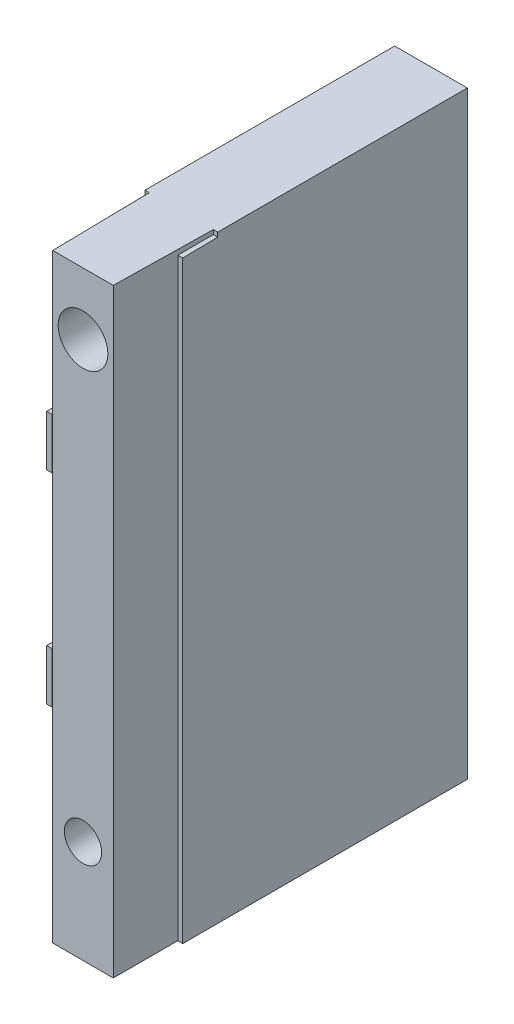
ISO-10303-21;
HEADER;
FILE_DESCRIPTION(('STEP AP214'),'2;1');
FILE_NAME('part.step','',(''),(''),'','','');
FILE_SCHEMA(('AUTOMOTIVE_DESIGN { 1 0 10303 214 1 1 1 1 }'));
ENDSEC;
DATA;
#1=APPLICATION_CONTEXT('core data for automotive mechanical design processes');
#2=APPLICATION_PROTOCOL_DEFINITION('international standard','automotive_design',2000,#1);
#3=PRODUCT_CONTEXT('',#1,'mechanical');
#4=PRODUCT('Part','Part','',(#3));
#5=PRODUCT_RELATED_PRODUCT_CATEGORY('part','',(#4));
#6=PRODUCT_DEFINITION_FORMATION('','',#4);
#7=PRODUCT_DEFINITION_CONTEXT('part definition',#1,'design');
#8=PRODUCT_DEFINITION('design','',#6,#7);
#9=PRODUCT_DEFINITION_SHAPE('','',#8);
#10=(LENGTH_UNIT() NAMED_UNIT(*) SI_UNIT(.MILLI.,.METRE.));
#11=(NAMED_UNIT(*) PLANE_ANGLE_UNIT() SI_UNIT($,.RADIAN.));
#12=(NAMED_UNIT(*) SI_UNIT($,.STERADIAN.) SOLID_ANGLE_UNIT());
#13=UNCERTAINTY_MEASURE_WITH_UNIT(LENGTH_MEASURE(1.E-05),#10,'distance_accuracy_value','');
#14=(GEOMETRIC_REPRESENTATION_CONTEXT(3) GLOBAL_UNCERTAINTY_ASSIGNED_CONTEXT((#13)) GLOBAL_UNIT_ASSIGNED_CONTEXT((#10,
#11,#12)) REPRESENTATION_CONTEXT('',''));
#15=CARTESIAN_POINT('',(0.,0.,0.));
#16=DIRECTION('',(0.,0.,1.));
#17=DIRECTION('',(1.,0.,0.));
#18=AXIS2_PLACEMENT_3D('',#15,#16,#17);
#19=CARTESIAN_POINT('',(-91.8,64.515,0.));
#20=DIRECTION('',(0.,0.,1.));
#21=DIRECTION('',(1.,0.,0.));
#22=AXIS2_PLACEMENT_3D('',#19,#20,#21);
#23=PLANE('',#22);
#24=CARTESIAN_POINT('',(8.02628761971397E-06,30.,0.));
#25=DIRECTION('',(0.,0.,1.));
#26=DIRECTION('',(1.,0.,0.));
#27=AXIS2_PLACEMENT_3D('',#24,#25,#26);
#28=CIRCLE('',#27,4.);
#29=CARTESIAN_POINT('',(4.00000802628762,30.,0.));
#30=VERTEX_POINT('',#29);
#31=EDGE_CURVE('E509',#30,#30,#28,.T.);
#32=ORIENTED_EDGE('',*,*,#31,.F.);
#33=EDGE_LOOP('',(#32));
#34=FACE_BOUND('',#33,.T.);
#35=CARTESIAN_POINT('',(8.02628752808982E-06,-40.,0.));
#36=DIRECTION('',(0.,0.,1.));
#37=DIRECTION('',(1.,0.,0.));
#38=AXIS2_PLACEMENT_3D('',#35,#36,#37);
#39=CIRCLE('',#38,3.);
#40=CARTESIAN_POINT('',(3.00000802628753,-40.,0.));
#41=VERTEX_POINT('',#40);
#42=EDGE_CURVE('E482',#41,#41,#39,.F.);
#43=ORIENTED_EDGE('',*,*,#42,.T.);
#44=EDGE_LOOP('',(#43));
#45=FACE_BOUND('',#44,.T.);
#46=DIRECTION('',(-1.,0.,0.));
#47=VECTOR('',#46,1.);
#48=CARTESIAN_POINT('',(-91.8,-56.5330416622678,0.));
#49=LINE('',#48,#47);
#50=CARTESIAN_POINT('',(4.87095833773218,-56.5330416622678,0.));
#51=VERTEX_POINT('',#50);
#52=CARTESIAN_POINT('',(-4.87095833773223,-56.5330416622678,0.));
#53=VERTEX_POINT('',#52);
#54=EDGE_CURVE('E334',#51,#53,#49,.T.);
#55=ORIENTED_EDGE('',*,*,#54,.F.);
#56=DIRECTION('',(0.,-1.,0.));
#57=VECTOR('',#56,1.);
#58=CARTESIAN_POINT('',(4.87095833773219,41.565,0.));
#59=LINE('',#58,#57);
#60=CARTESIAN_POINT('',(4.87095833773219,39.9924836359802,0.));
#61=VERTEX_POINT('',#60);
#62=EDGE_CURVE('E313',#51,#61,#59,.F.);
#63=ORIENTED_EDGE('',*,*,#62,.T.);
#64=DIRECTION('',(-1.,0.,0.));
#65=VECTOR('',#64,1.);
#66=CARTESIAN_POINT('',(-65.6145427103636,39.9924836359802,0.));
#67=LINE('',#66,#65);
#68=CARTESIAN_POINT('',(-4.87095833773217,39.9924836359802,0.));
#69=VERTEX_POINT('',#68);
#70=EDGE_CURVE('E521',#69,#61,#67,.F.);
#71=ORIENTED_EDGE('',*,*,#70,.F.);
#72=DIRECTION('',(0.,1.,0.));
#73=VECTOR('',#72,1.);
#74=CARTESIAN_POINT('',(-4.87095833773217,41.565,0.));
#75=LINE('',#74,#73);
#76=EDGE_CURVE('E309',#69,#53,#75,.F.);
#77=ORIENTED_EDGE('',*,*,#76,.T.);
#78=EDGE_LOOP('',(#55,#63,#71,#77));
#79=FACE_BOUND('',#78,.T.);
#80=ADVANCED_FACE('F38',(#34,#45,#79),#23,.T.);
#81=CARTESIAN_POINT('',(-5.84844197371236,28.1390208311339,-56.));
#82=DIRECTION('',(-1.,0.,0.));
#83=DIRECTION('',(0.,-1.,0.));
#84=AXIS2_PLACEMENT_3D('',#81,#82,#83);
#85=PLANE('',#84);
#86=DIRECTION('',(0.,-0.0174524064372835,0.999847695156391));
#87=VECTOR('',#86,1.);
#88=CARTESIAN_POINT('',(-5.84844197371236,39.9888732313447,-55.7931600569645));
#89=LINE('',#88,#87);
#90=CARTESIAN_POINT('',(-5.84844197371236,39.2911319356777,-15.819588));
#91=VERTEX_POINT('',#90);
#92=CARTESIAN_POINT('',(-5.84844197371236,39.1930416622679,-10.2));
#93=VERTEX_POINT('',#92);
#94=EDGE_CURVE('E533',#91,#93,#89,.T.);
#95=ORIENTED_EDGE('',*,*,#94,.F.);
#96=DIRECTION('',(0.,1.,0.));
#97=VECTOR('',#96,1.);
#98=CARTESIAN_POINT('',(-5.84844197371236,28.1390208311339,-15.819588));
#99=LINE('',#98,#97);
#100=CARTESIAN_POINT('',(-5.84844197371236,39.9924836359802,-15.819588));
#101=VERTEX_POINT('',#100);
#102=EDGE_CURVE('E270',#91,#101,#99,.T.);
#103=ORIENTED_EDGE('',*,*,#102,.T.);
#104=DIRECTION('',(0.,0.,1.));
#105=VECTOR('',#104,1.);
#106=CARTESIAN_POINT('',(-5.84844197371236,39.9924836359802,0.168862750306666));
#107=LINE('',#106,#105);
#108=CARTESIAN_POINT('',(-5.84844197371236,39.9924906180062,-56.));
#109=VERTEX_POINT('',#108);
#110=EDGE_CURVE('E269',#101,#109,#107,.F.);
#111=ORIENTED_EDGE('',*,*,#110,.T.);
#112=DIRECTION('',(0.,1.,0.));
#113=VECTOR('',#112,1.);
#114=CARTESIAN_POINT('',(-5.84844197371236,28.1390208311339,-56.));
#115=LINE('',#114,#113);
#116=CARTESIAN_POINT('',(-5.8484419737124,-56.355,-56.));
#117=VERTEX_POINT('',#116);
#118=EDGE_CURVE('E455',#117,#109,#115,.T.);
#119=ORIENTED_EDGE('',*,*,#118,.F.);
#120=DIRECTION('',(0.,0.,1.));
#121=VECTOR('',#120,1.);
#122=CARTESIAN_POINT('',(-5.8484419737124,-56.355,-56.));
#123=LINE('',#122,#121);
#124=CARTESIAN_POINT('',(-5.8484419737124,-56.355,-10.2));
#125=VERTEX_POINT('',#124);
#126=EDGE_CURVE('E362',#125,#117,#123,.F.);
#127=ORIENTED_EDGE('',*,*,#126,.F.);
#128=DIRECTION('',(0.,1.,0.));
#129=VECTOR('',#128,1.);
#130=CARTESIAN_POINT('',(-5.84844197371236,28.1390208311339,-10.2));
#131=LINE('',#130,#129);
#132=CARTESIAN_POINT('',(-5.84844197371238,-23.715,-10.2));
#133=VERTEX_POINT('',#132);
#134=EDGE_CURVE('E352',#125,#133,#131,.T.);
#135=ORIENTED_EDGE('',*,*,#134,.T.);
#136=DIRECTION('',(0.,0.,-1.));
#137=VECTOR('',#136,1.);
#138=CARTESIAN_POINT('',(-5.84844197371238,-23.715,-10.2));
#139=LINE('',#138,#137);
#140=CARTESIAN_POINT('',(-5.84844197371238,-23.715,0.));
#141=VERTEX_POINT('',#140);
#142=EDGE_CURVE('E410',#141,#133,#139,.T.);
#143=ORIENTED_EDGE('',*,*,#142,.F.);
#144=DIRECTION('',(0.,1.,0.));
#145=VECTOR('',#144,1.);
#146=CARTESIAN_POINT('',(-5.84844197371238,64.515,0.));
#147=LINE('',#146,#145);
#148=CARTESIAN_POINT('',(-5.84844197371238,-15.555,0.));
#149=VERTEX_POINT('',#148);
#150=EDGE_CURVE('E335',#141,#149,#147,.T.);
#151=ORIENTED_EDGE('',*,*,#150,.T.);
#152=DIRECTION('',(0.,0.,1.));
#153=VECTOR('',#152,1.);
#154=CARTESIAN_POINT('',(-5.84844197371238,-15.555,-10.2));
#155=LINE('',#154,#153);
#156=CARTESIAN_POINT('',(-5.84844197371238,-15.555,-10.2));
#157=VERTEX_POINT('',#156);
#158=EDGE_CURVE('E430',#157,#149,#155,.T.);
#159=ORIENTED_EDGE('',*,*,#158,.F.);
#160=CARTESIAN_POINT('',(-5.84844197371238,8.925,-10.2));
#161=VERTEX_POINT('',#160);
#162=EDGE_CURVE('E357',#157,#161,#131,.T.);
#163=ORIENTED_EDGE('',*,*,#162,.T.);
#164=DIRECTION('',(0.,0.,-1.));
#165=VECTOR('',#164,1.);
#166=CARTESIAN_POINT('',(-5.84844197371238,8.925,-10.2));
#167=LINE('',#166,#165);
#168=CARTESIAN_POINT('',(-5.84844197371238,8.925,0.));
#169=VERTEX_POINT('',#168);
#170=EDGE_CURVE('E298',#169,#161,#167,.T.);
#171=ORIENTED_EDGE('',*,*,#170,.F.);
#172=DIRECTION('',(0.,1.,0.));
#173=VECTOR('',#172,1.);
#174=CARTESIAN_POINT('',(-5.84844197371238,64.515,0.));
#175=LINE('',#174,#173);
#176=CARTESIAN_POINT('',(-5.84844197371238,17.085,0.));
#177=VERTEX_POINT('',#176);
#178=EDGE_CURVE('E277',#169,#177,#175,.T.);
#179=ORIENTED_EDGE('',*,*,#178,.T.);
#180=DIRECTION('',(0.,0.,-1.));
#181=VECTOR('',#180,1.);
#182=CARTESIAN_POINT('',(-5.84844197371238,17.085,-10.2));
#183=LINE('',#182,#181);
#184=CARTESIAN_POINT('',(-5.84844197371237,17.085,-10.2));
#185=VERTEX_POINT('',#184);
#186=EDGE_CURVE('E53',#177,#185,#183,.T.);
#187=ORIENTED_EDGE('',*,*,#186,.T.);
#188=EDGE_CURVE('E369',#185,#93,#131,.T.);
#189=ORIENTED_EDGE('',*,*,#188,.T.);
#190=EDGE_LOOP('',(#95,#103,#111,#119,#127,#135,#143,#151,#159,#163,#171,#179,#187,#189));
#191=FACE_BOUND('',#190,.T.);
#192=ADVANCED_FACE('F209',(#191),#85,.T.);
#193=CARTESIAN_POINT('',(5.84844197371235,-8.67,-56.));
#194=DIRECTION('',(1.,0.,0.));
#195=DIRECTION('',(0.,1.,0.));
#196=AXIS2_PLACEMENT_3D('',#193,#194,#195);
#197=PLANE('',#196);
#198=DIRECTION('',(0.,0.,-1.));
#199=VECTOR('',#198,1.);
#200=CARTESIAN_POINT('',(5.84844197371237,39.9924836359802,0.168862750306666));
#201=LINE('',#200,#199);
#202=CARTESIAN_POINT('',(5.84844197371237,39.9924906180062,-56.));
#203=VERTEX_POINT('',#202);
#204=CARTESIAN_POINT('',(5.84844197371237,39.9924836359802,-15.819588));
#205=VERTEX_POINT('',#204);
#206=EDGE_CURVE('E261',#203,#205,#201,.F.);
#207=ORIENTED_EDGE('',*,*,#206,.T.);
#208=DIRECTION('',(0.,-1.,0.));
#209=VECTOR('',#208,1.);
#210=CARTESIAN_POINT('',(5.84844197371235,-8.67,-15.819588));
#211=LINE('',#210,#209);
#212=CARTESIAN_POINT('',(5.84844197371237,39.2911319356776,-15.819588));
#213=VERTEX_POINT('',#212);
#214=EDGE_CURVE('E263',#205,#213,#211,.T.);
#215=ORIENTED_EDGE('',*,*,#214,.T.);
#216=DIRECTION('',(0.,0.0174524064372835,-0.999847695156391));
#217=VECTOR('',#216,1.);
#218=CARTESIAN_POINT('',(5.84844197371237,39.9776617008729,-55.1508519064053));
#219=LINE('',#218,#217);
#220=CARTESIAN_POINT('',(5.84844197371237,39.1930416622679,-10.2));
#221=VERTEX_POINT('',#220);
#222=EDGE_CURVE('E467',#221,#213,#219,.T.);
#223=ORIENTED_EDGE('',*,*,#222,.F.);
#224=DIRECTION('',(0.,-1.,0.));
#225=VECTOR('',#224,1.);
#226=CARTESIAN_POINT('',(5.84844197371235,-8.67,-10.2));
#227=LINE('',#226,#225);
#228=CARTESIAN_POINT('',(5.84844197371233,-56.355,-10.2));
#229=VERTEX_POINT('',#228);
#230=EDGE_CURVE('E356',#221,#229,#227,.T.);
#231=ORIENTED_EDGE('',*,*,#230,.T.);
#232=DIRECTION('',(0.,0.,-1.));
#233=VECTOR('',#232,1.);
#234=CARTESIAN_POINT('',(5.84844197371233,-56.355,-56.));
#235=LINE('',#234,#233);
#236=CARTESIAN_POINT('',(5.84844197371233,-56.355,-56.));
#237=VERTEX_POINT('',#236);
#238=EDGE_CURVE('E364',#237,#229,#235,.F.);
#239=ORIENTED_EDGE('',*,*,#238,.F.);
#240=DIRECTION('',(0.,-1.,0.));
#241=VECTOR('',#240,1.);
#242=CARTESIAN_POINT('',(5.84844197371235,-8.67,-56.));
#243=LINE('',#242,#241);
#244=EDGE_CURVE('E265',#203,#237,#243,.T.);
#245=ORIENTED_EDGE('',*,*,#244,.F.);
#246=EDGE_LOOP('',(#207,#215,#223,#231,#239,#245));
#247=FACE_BOUND('',#246,.T.);
#248=ADVANCED_FACE('F215',(#247),#197,.T.);
#249=CARTESIAN_POINT('',(-65.6145427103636,39.9924836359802,-56.));
#250=DIRECTION('',(0.,-1.,0.));
#251=DIRECTION('',(1.,0.,0.));
#252=AXIS2_PLACEMENT_3D('',#249,#250,#251);
#253=PLANE('',#252);
#254=ORIENTED_EDGE('',*,*,#110,.F.);
#255=DIRECTION('',(-1.,0.,0.));
#256=VECTOR('',#255,1.);
#257=CARTESIAN_POINT('',(-65.6145427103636,39.9924836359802,-15.819588));
#258=LINE('',#257,#256);
#259=CARTESIAN_POINT('',(-5.14709027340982,39.9924836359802,-15.819588));
#260=VERTEX_POINT('',#259);
#261=EDGE_CURVE('E304',#101,#260,#258,.F.);
#262=ORIENTED_EDGE('',*,*,#261,.T.);
#263=DIRECTION('',(0.0174524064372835,0.,0.999847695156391));
#264=VECTOR('',#263,1.);
#265=CARTESIAN_POINT('',(-5.86664592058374,39.9924836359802,-57.0429034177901));
#266=LINE('',#265,#264);
#267=EDGE_CURVE('E537',#260,#69,#266,.T.);
#268=ORIENTED_EDGE('',*,*,#267,.T.);
#269=ORIENTED_EDGE('',*,*,#70,.T.);
#270=DIRECTION('',(0.0174524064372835,0.,-0.999847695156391));
#271=VECTOR('',#270,1.);
#272=CARTESIAN_POINT('',(5.82667531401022,39.9924836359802,-54.7529889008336));
#273=LINE('',#272,#271);
#274=CARTESIAN_POINT('',(5.14709027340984,39.9924836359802,-15.819588));
#275=VERTEX_POINT('',#274);
#276=EDGE_CURVE('E529',#61,#275,#273,.T.);
#277=ORIENTED_EDGE('',*,*,#276,.T.);
#278=DIRECTION('',(-1.,0.,0.));
#279=VECTOR('',#278,1.);
#280=CARTESIAN_POINT('',(-65.6145427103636,39.9924836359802,-15.819588));
#281=LINE('',#280,#279);
#282=EDGE_CURVE('E302',#275,#205,#281,.F.);
#283=ORIENTED_EDGE('',*,*,#282,.T.);
#284=ORIENTED_EDGE('',*,*,#206,.F.);
#285=DIRECTION('',(-1.,0.,0.));
#286=VECTOR('',#285,1.);
#287=CARTESIAN_POINT('',(-91.8,39.9924836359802,-56.));
#288=LINE('',#287,#286);
#289=EDGE_CURVE('E559',#203,#109,#288,.T.);
#290=ORIENTED_EDGE('',*,*,#289,.T.);
#291=EDGE_LOOP('',(#254,#262,#268,#269,#277,#283,#284,#290));
#292=FACE_BOUND('',#291,.T.);
#293=ADVANCED_FACE('F251',(#292),#253,.F.);
#294=CARTESIAN_POINT('',(-13.0797139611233,-40.035,-10.2));
#295=DIRECTION('',(0.,0.,1.));
#296=DIRECTION('',(1.,0.,0.));
#297=AXIS2_PLACEMENT_3D('',#294,#295,#296);
#298=PLANE('',#297);
#299=DIRECTION('',(0.,1.,0.));
#300=VECTOR('',#299,1.);
#301=CARTESIAN_POINT('',(-5.049,28.1390208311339,-10.2));
#302=LINE('',#301,#300);
#303=CARTESIAN_POINT('',(-5.049,-15.555,-10.2));
#304=VERTEX_POINT('',#303);
#305=CARTESIAN_POINT('',(-5.049,8.925,-10.2));
#306=VERTEX_POINT('',#305);
#307=EDGE_CURVE('E338',#304,#306,#302,.T.);
#308=ORIENTED_EDGE('',*,*,#307,.T.);
#309=DIRECTION('',(-1.,0.,0.));
#310=VECTOR('',#309,1.);
#311=CARTESIAN_POINT('',(-5.049,8.925,-10.2));
#312=LINE('',#311,#310);
#313=EDGE_CURVE('E291',#306,#161,#312,.T.);
#314=ORIENTED_EDGE('',*,*,#313,.T.);
#315=ORIENTED_EDGE('',*,*,#162,.F.);
#316=DIRECTION('',(1.,0.,0.));
#317=VECTOR('',#316,1.);
#318=CARTESIAN_POINT('',(-7.089,-15.555,-10.2));
#319=LINE('',#318,#317);
#320=EDGE_CURVE('E418',#157,#304,#319,.T.);
#321=ORIENTED_EDGE('',*,*,#320,.T.);
#322=EDGE_LOOP('',(#308,#314,#315,#321));
#323=FACE_BOUND('',#322,.T.);
#324=ADVANCED_FACE('F243',(#323),#298,.T.);
#325=DIRECTION('',(-1.,0.,0.));
#326=VECTOR('',#325,1.);
#327=CARTESIAN_POINT('',(-5.049,17.085,-10.2));
#328=LINE('',#327,#326);
#329=CARTESIAN_POINT('',(-5.049,17.085,-10.2));
#330=VERTEX_POINT('',#329);
#331=EDGE_CURVE('E295',#330,#185,#328,.T.);
#332=ORIENTED_EDGE('',*,*,#331,.F.);
#333=CARTESIAN_POINT('',(-5.049,39.1930416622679,-10.2));
#334=VERTEX_POINT('',#333);
#335=EDGE_CURVE('E342',#330,#334,#302,.T.);
#336=ORIENTED_EDGE('',*,*,#335,.T.);
#337=DIRECTION('',(-1.,0.,0.));
#338=VECTOR('',#337,1.);
#339=CARTESIAN_POINT('',(-91.8,39.1930416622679,-10.2));
#340=LINE('',#339,#338);
#341=EDGE_CURVE('E468',#334,#93,#340,.T.);
#342=ORIENTED_EDGE('',*,*,#341,.T.);
#343=ORIENTED_EDGE('',*,*,#188,.F.);
#344=EDGE_LOOP('',(#332,#336,#342,#343));
#345=FACE_BOUND('',#344,.T.);
#346=ADVANCED_FACE('F566',(#345),#298,.T.);
#347=CARTESIAN_POINT('',(-5.049,-56.355,-10.2));
#348=VERTEX_POINT('',#347);
#349=CARTESIAN_POINT('',(-5.049,-23.715,-10.2));
#350=VERTEX_POINT('',#349);
#351=EDGE_CURVE('E341',#348,#350,#302,.T.);
#352=ORIENTED_EDGE('',*,*,#351,.T.);
#353=DIRECTION('',(-1.,0.,0.));
#354=VECTOR('',#353,1.);
#355=CARTESIAN_POINT('',(-5.049,-23.715,-10.2));
#356=LINE('',#355,#354);
#357=EDGE_CURVE('E61',#350,#133,#356,.T.);
#358=ORIENTED_EDGE('',*,*,#357,.T.);
#359=ORIENTED_EDGE('',*,*,#134,.F.);
#360=DIRECTION('',(-1.,0.,0.));
#361=VECTOR('',#360,1.);
#362=CARTESIAN_POINT('',(-12.6354791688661,-56.355,-10.2));
#363=LINE('',#362,#361);
#364=EDGE_CURVE('E448',#348,#125,#363,.T.);
#365=ORIENTED_EDGE('',*,*,#364,.F.);
#366=EDGE_LOOP('',(#352,#358,#359,#365));
#367=FACE_BOUND('',#366,.T.);
#368=ADVANCED_FACE('F233',(#367),#298,.T.);
#369=CARTESIAN_POINT('',(-4.95997916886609,28.1390208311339,-5.1));
#370=DIRECTION('',(-0.999847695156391,0.,0.0174524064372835));
#371=DIRECTION('',(0.0174524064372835,0.,0.999847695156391));
#372=AXIS2_PLACEMENT_3D('',#369,#370,#371);
#373=PLANE('',#372);
#374=DIRECTION('',(-0.0174497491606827,0.0174497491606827,-0.999695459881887));
#375=VECTOR('',#374,1.);
#376=CARTESIAN_POINT('',(-4.98573417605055,-56.4182658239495,-6.57550337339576));
#377=LINE('',#376,#375);
#378=EDGE_CURVE('E432',#53,#348,#377,.T.);
#379=ORIENTED_EDGE('',*,*,#378,.F.);
#380=ORIENTED_EDGE('',*,*,#76,.F.);
#381=ORIENTED_EDGE('',*,*,#267,.F.);
#382=DIRECTION('',(0.,-1.,0.));
#383=VECTOR('',#382,1.);
#384=CARTESIAN_POINT('',(-5.14709027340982,41.565,-15.819588));
#385=LINE('',#384,#383);
#386=CARTESIAN_POINT('',(-5.14709027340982,39.2911319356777,-15.819588));
#387=VERTEX_POINT('',#386);
#388=EDGE_CURVE('E522',#387,#260,#385,.F.);
#389=ORIENTED_EDGE('',*,*,#388,.F.);
#390=DIRECTION('',(0.0174497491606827,-0.0174497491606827,0.999695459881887));
#391=VECTOR('',#390,1.);
#392=CARTESIAN_POINT('',(-4.89742768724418,39.041469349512,-1.51642801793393));
#393=LINE('',#392,#391);
#394=EDGE_CURVE('E314',#334,#387,#393,.F.);
#395=ORIENTED_EDGE('',*,*,#394,.F.);
#396=ORIENTED_EDGE('',*,*,#335,.F.);
#397=DIRECTION('',(-0.0174524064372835,0.,-0.999847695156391));
#398=VECTOR('',#397,1.);
#399=CARTESIAN_POINT('',(-4.95997916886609,17.085,-5.1));
#400=LINE('',#399,#398);
#401=CARTESIAN_POINT('',(-4.95997916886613,17.085,-5.10000000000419));
#402=VERTEX_POINT('',#401);
#403=EDGE_CURVE('E384',#402,#330,#400,.T.);
#404=ORIENTED_EDGE('',*,*,#403,.F.);
#405=DIRECTION('',(0.,1.,0.));
#406=VECTOR('',#405,1.);
#407=CARTESIAN_POINT('',(-4.95997916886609,28.1390208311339,-5.1));
#408=LINE('',#407,#406);
#409=CARTESIAN_POINT('',(-4.95997916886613,8.925,-5.10000000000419));
#410=VERTEX_POINT('',#409);
#411=EDGE_CURVE('E305',#402,#410,#408,.F.);
#412=ORIENTED_EDGE('',*,*,#411,.T.);
#413=DIRECTION('',(-0.0174524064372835,0.,-0.999847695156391));
#414=VECTOR('',#413,1.);
#415=CARTESIAN_POINT('',(-4.95997916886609,8.925,-5.1));
#416=LINE('',#415,#414);
#417=EDGE_CURVE('E279',#410,#306,#416,.T.);
#418=ORIENTED_EDGE('',*,*,#417,.T.);
#419=ORIENTED_EDGE('',*,*,#307,.F.);
#420=DIRECTION('',(0.0174524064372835,0.,0.999847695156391));
#421=VECTOR('',#420,1.);
#422=CARTESIAN_POINT('',(-4.95997916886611,-15.555,-5.1));
#423=LINE('',#422,#421);
#424=CARTESIAN_POINT('',(-4.95997916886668,-15.555,-5.10000000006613));
#425=VERTEX_POINT('',#424);
#426=EDGE_CURVE('E349',#304,#425,#423,.T.);
#427=ORIENTED_EDGE('',*,*,#426,.T.);
#428=DIRECTION('',(0.,1.,0.));
#429=VECTOR('',#428,1.);
#430=CARTESIAN_POINT('',(-4.95997916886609,28.1390208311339,-5.1));
#431=LINE('',#430,#429);
#432=CARTESIAN_POINT('',(-4.95997916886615,-23.715,-5.10000000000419));
#433=VERTEX_POINT('',#432);
#434=EDGE_CURVE('E345',#425,#433,#431,.F.);
#435=ORIENTED_EDGE('',*,*,#434,.T.);
#436=DIRECTION('',(-0.0174524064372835,0.,-0.999847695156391));
#437=VECTOR('',#436,1.);
#438=CARTESIAN_POINT('',(-4.95997916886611,-23.715,-5.1));
#439=LINE('',#438,#437);
#440=EDGE_CURVE('E343',#433,#350,#439,.T.);
#441=ORIENTED_EDGE('',*,*,#440,.T.);
#442=ORIENTED_EDGE('',*,*,#351,.F.);
#443=EDGE_LOOP('',(#379,#380,#381,#389,#395,#396,#404,#412,#418,#419,#427,#435,#441,#442));
#444=FACE_BOUND('',#443,.T.);
#445=ADVANCED_FACE('F229',(#444),#373,.T.);
#446=CARTESIAN_POINT('',(5.049,39.1930416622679,-10.2));
#447=VERTEX_POINT('',#446);
#448=EDGE_CURVE('E471',#221,#447,#340,.T.);
#449=ORIENTED_EDGE('',*,*,#448,.T.);
#450=DIRECTION('',(0.,-1.,0.));
#451=VECTOR('',#450,1.);
#452=CARTESIAN_POINT('',(5.049,-8.67,-10.2));
#453=LINE('',#452,#451);
#454=CARTESIAN_POINT('',(5.049,-56.355,-10.2));
#455=VERTEX_POINT('',#454);
#456=EDGE_CURVE('E312',#447,#455,#453,.T.);
#457=ORIENTED_EDGE('',*,*,#456,.T.);
#458=EDGE_CURVE('E451',#229,#455,#363,.T.);
#459=ORIENTED_EDGE('',*,*,#458,.F.);
#460=ORIENTED_EDGE('',*,*,#230,.F.);
#461=EDGE_LOOP('',(#449,#457,#459,#460));
#462=FACE_BOUND('',#461,.T.);
#463=ADVANCED_FACE('F232',(#462),#298,.T.);
#464=CARTESIAN_POINT('',(170.,-124.,-56.));
#465=DIRECTION('',(0.,0.,1.));
#466=DIRECTION('',(1.,0.,0.));
#467=AXIS2_PLACEMENT_3D('',#464,#465,#466);
#468=PLANE('',#467);
#469=CARTESIAN_POINT('',(8.02628761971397E-06,30.,-56.));
#470=DIRECTION('',(0.,0.,1.));
#471=DIRECTION('',(1.,0.,0.));
#472=AXIS2_PLACEMENT_3D('',#469,#470,#471);
#473=CIRCLE('',#472,4.);
#474=CARTESIAN_POINT('',(4.00000802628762,30.,-56.));
#475=VERTEX_POINT('',#474);
#476=EDGE_CURVE('E504',#475,#475,#473,.T.);
#477=ORIENTED_EDGE('',*,*,#476,.T.);
#478=EDGE_LOOP('',(#477));
#479=FACE_BOUND('',#478,.T.);
#480=CARTESIAN_POINT('',(8.02628760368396E-06,17.9924836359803,-56.));
#481=DIRECTION('',(0.,0.,1.));
#482=DIRECTION('',(1.,0.,0.));
#483=AXIS2_PLACEMENT_3D('',#480,#481,#482);
#484=CIRCLE('',#483,3.);
#485=CARTESIAN_POINT('',(3.0000080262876,17.9924836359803,-56.));
#486=VERTEX_POINT('',#485);
#487=EDGE_CURVE('E46',#486,#486,#484,.T.);
#488=ORIENTED_EDGE('',*,*,#487,.T.);
#489=EDGE_LOOP('',(#488));
#490=FACE_BOUND('',#489,.T.);
#491=CARTESIAN_POINT('',(8.02628751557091E-06,-49.355,-56.));
#492=DIRECTION('',(0.,0.,1.));
#493=DIRECTION('',(1.,0.,0.));
#494=AXIS2_PLACEMENT_3D('',#491,#492,#493);
#495=CIRCLE('',#494,3.);
#496=CARTESIAN_POINT('',(3.00000802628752,-49.355,-56.));
#497=VERTEX_POINT('',#496);
#498=EDGE_CURVE('E308',#497,#497,#495,.T.);
#499=ORIENTED_EDGE('',*,*,#498,.T.);
#500=EDGE_LOOP('',(#499));
#501=FACE_BOUND('',#500,.T.);
#502=CARTESIAN_POINT('',(8.02628752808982E-06,-40.,-56.));
#503=DIRECTION('',(0.,0.,1.));
#504=DIRECTION('',(1.,0.,0.));
#505=AXIS2_PLACEMENT_3D('',#502,#503,#504);
#506=CIRCLE('',#505,3.);
#507=CARTESIAN_POINT('',(3.00000802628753,-40.,-56.));
#508=VERTEX_POINT('',#507);
#509=EDGE_CURVE('E478',#508,#508,#506,.T.);
#510=ORIENTED_EDGE('',*,*,#509,.T.);
#511=EDGE_LOOP('',(#510));
#512=FACE_BOUND('',#511,.T.);
#513=ORIENTED_EDGE('',*,*,#244,.T.);
#514=DIRECTION('',(-1.,0.,0.));
#515=VECTOR('',#514,1.);
#516=CARTESIAN_POINT('',(-12.6354791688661,-56.355,-56.));
#517=LINE('',#516,#515);
#518=EDGE_CURVE('E346',#117,#237,#517,.F.);
#519=ORIENTED_EDGE('',*,*,#518,.F.);
#520=ORIENTED_EDGE('',*,*,#118,.T.);
#521=ORIENTED_EDGE('',*,*,#289,.F.);
#522=EDGE_LOOP('',(#513,#519,#520,#521));
#523=FACE_BOUND('',#522,.T.);
#524=ADVANCED_FACE('F241',(#479,#490,#501,#512,#523),#468,.F.);
#525=CARTESIAN_POINT('',(-12.6354791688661,-56.355,-10.2));
#526=DIRECTION('',(0.,-1.,0.));
#527=DIRECTION('',(1.,0.,0.));
#528=AXIS2_PLACEMENT_3D('',#525,#526,#527);
#529=PLANE('',#528);
#530=ORIENTED_EDGE('',*,*,#238,.T.);
#531=ORIENTED_EDGE('',*,*,#458,.T.);
#532=DIRECTION('',(-1.,0.,0.));
#533=VECTOR('',#532,1.);
#534=CARTESIAN_POINT('',(-12.6354791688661,-56.355,-10.2));
#535=LINE('',#534,#533);
#536=EDGE_CURVE('E329',#455,#348,#535,.T.);
#537=ORIENTED_EDGE('',*,*,#536,.T.);
#538=ORIENTED_EDGE('',*,*,#364,.T.);
#539=ORIENTED_EDGE('',*,*,#126,.T.);
#540=ORIENTED_EDGE('',*,*,#518,.T.);
#541=EDGE_LOOP('',(#530,#531,#537,#538,#539,#540));
#542=FACE_BOUND('',#541,.T.);
#543=ADVANCED_FACE('F237',(#542),#529,.T.);
#544=CARTESIAN_POINT('',(4.95997916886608,-8.67,-5.1));
#545=DIRECTION('',(0.999847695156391,0.,0.0174524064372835));
#546=DIRECTION('',(0.0174524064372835,0.,-0.999847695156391));
#547=AXIS2_PLACEMENT_3D('',#544,#545,#546);
#548=PLANE('',#547);
#549=ORIENTED_EDGE('',*,*,#456,.F.);
#550=DIRECTION('',(0.0174497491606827,0.0174497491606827,-0.999695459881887));
#551=VECTOR('',#550,1.);
#552=CARTESIAN_POINT('',(4.84152263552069,38.9855642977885,1.68637025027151));
#553=LINE('',#552,#551);
#554=CARTESIAN_POINT('',(5.14709027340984,39.2911319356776,-15.819588));
#555=VERTEX_POINT('',#554);
#556=EDGE_CURVE('E518',#555,#447,#553,.F.);
#557=ORIENTED_EDGE('',*,*,#556,.F.);
#558=DIRECTION('',(0.,-1.,0.));
#559=VECTOR('',#558,1.);
#560=CARTESIAN_POINT('',(5.14709027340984,39.015,-15.819588));
#561=LINE('',#560,#559);
#562=EDGE_CURVE('E481',#555,#275,#561,.F.);
#563=ORIENTED_EDGE('',*,*,#562,.T.);
#564=ORIENTED_EDGE('',*,*,#276,.F.);
#565=ORIENTED_EDGE('',*,*,#62,.F.);
#566=DIRECTION('',(-0.0174497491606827,-0.0174497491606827,0.999695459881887));
#567=VECTOR('',#566,1.);
#568=CARTESIAN_POINT('',(4.97452605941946,-56.4294739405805,-5.93339080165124));
#569=LINE('',#568,#567);
#570=EDGE_CURVE('E332',#455,#51,#569,.T.);
#571=ORIENTED_EDGE('',*,*,#570,.F.);
#572=EDGE_LOOP('',(#549,#557,#563,#564,#565,#571));
#573=FACE_BOUND('',#572,.T.);
#574=ADVANCED_FACE('F227',(#573),#548,.T.);
#575=CARTESIAN_POINT('',(-12.6354791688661,-56.4440208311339,-5.1));
#576=DIRECTION('',(0.,0.999847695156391,0.0174524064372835));
#577=DIRECTION('',(0.,-0.0174524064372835,0.999847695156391));
#578=AXIS2_PLACEMENT_3D('',#575,#576,#577);
#579=PLANE('',#578);
#580=ORIENTED_EDGE('',*,*,#536,.F.);
#581=ORIENTED_EDGE('',*,*,#570,.T.);
#582=ORIENTED_EDGE('',*,*,#54,.T.);
#583=ORIENTED_EDGE('',*,*,#378,.T.);
#584=EDGE_LOOP('',(#580,#581,#582,#583));
#585=FACE_BOUND('',#584,.T.);
#586=ADVANCED_FACE('F223',(#585),#579,.F.);
#587=CARTESIAN_POINT('',(-4.95997916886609,28.1390208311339,-56.));
#588=DIRECTION('',(1.,0.,0.));
#589=DIRECTION('',(0.,1.,0.));
#590=AXIS2_PLACEMENT_3D('',#587,#588,#589);
#591=PLANE('',#590);
#592=ORIENTED_EDGE('',*,*,#434,.F.);
#593=DIRECTION('',(0.,0.,-1.));
#594=VECTOR('',#593,1.);
#595=CARTESIAN_POINT('',(-4.95997916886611,-15.555,-56.));
#596=LINE('',#595,#594);
#597=CARTESIAN_POINT('',(-4.95997916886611,-15.555,0.));
#598=VERTEX_POINT('',#597);
#599=EDGE_CURVE('E404',#425,#598,#596,.F.);
#600=ORIENTED_EDGE('',*,*,#599,.T.);
#601=DIRECTION('',(0.,1.,0.));
#602=VECTOR('',#601,1.);
#603=CARTESIAN_POINT('',(-4.95997916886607,64.515,0.));
#604=LINE('',#603,#602);
#605=CARTESIAN_POINT('',(-4.95997916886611,-23.715,0.));
#606=VERTEX_POINT('',#605);
#607=EDGE_CURVE('E414',#598,#606,#604,.F.);
#608=ORIENTED_EDGE('',*,*,#607,.T.);
#609=DIRECTION('',(0.,0.,-1.));
#610=VECTOR('',#609,1.);
#611=CARTESIAN_POINT('',(-4.95997916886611,-23.715,-10.2));
#612=LINE('',#611,#610);
#613=EDGE_CURVE('E421',#433,#606,#612,.F.);
#614=ORIENTED_EDGE('',*,*,#613,.F.);
#615=EDGE_LOOP('',(#592,#600,#608,#614));
#616=FACE_BOUND('',#615,.T.);
#617=ADVANCED_FACE('F226',(#616),#591,.T.);
#618=CARTESIAN_POINT('',(-7.089,-15.555,-10.2));
#619=DIRECTION('',(0.,-1.,0.));
#620=DIRECTION('',(0.,0.,-1.));
#621=AXIS2_PLACEMENT_3D('',#618,#619,#620);
#622=PLANE('',#621);
#623=ORIENTED_EDGE('',*,*,#426,.F.);
#624=ORIENTED_EDGE('',*,*,#320,.F.);
#625=ORIENTED_EDGE('',*,*,#158,.T.);
#626=DIRECTION('',(1.,0.,0.));
#627=VECTOR('',#626,1.);
#628=CARTESIAN_POINT('',(-7.089,-15.555,0.));
#629=LINE('',#628,#627);
#630=EDGE_CURVE('E411',#149,#598,#629,.T.);
#631=ORIENTED_EDGE('',*,*,#630,.T.);
#632=ORIENTED_EDGE('',*,*,#599,.F.);
#633=EDGE_LOOP('',(#623,#624,#625,#631,#632));
#634=FACE_BOUND('',#633,.T.);
#635=ADVANCED_FACE('F581',(#634),#622,.F.);
#636=CARTESIAN_POINT('',(-5.049,-23.715,-10.2));
#637=DIRECTION('',(0.,1.,0.));
#638=DIRECTION('',(0.,0.,1.));
#639=AXIS2_PLACEMENT_3D('',#636,#637,#638);
#640=PLANE('',#639);
#641=ORIENTED_EDGE('',*,*,#440,.F.);
#642=ORIENTED_EDGE('',*,*,#613,.T.);
#643=DIRECTION('',(-1.,0.,0.));
#644=VECTOR('',#643,1.);
#645=CARTESIAN_POINT('',(-5.049,-23.715,0.));
#646=LINE('',#645,#644);
#647=EDGE_CURVE('E407',#606,#141,#646,.T.);
#648=ORIENTED_EDGE('',*,*,#647,.T.);
#649=ORIENTED_EDGE('',*,*,#142,.T.);
#650=ORIENTED_EDGE('',*,*,#357,.F.);
#651=EDGE_LOOP('',(#641,#642,#648,#649,#650));
#652=FACE_BOUND('',#651,.T.);
#653=ADVANCED_FACE('F591',(#652),#640,.F.);
#654=CARTESIAN_POINT('',(-91.8,64.515,0.));
#655=DIRECTION('',(0.,0.,1.));
#656=DIRECTION('',(1.,0.,0.));
#657=AXIS2_PLACEMENT_3D('',#654,#655,#656);
#658=PLANE('',#657);
#659=ORIENTED_EDGE('',*,*,#150,.F.);
#660=ORIENTED_EDGE('',*,*,#647,.F.);
#661=ORIENTED_EDGE('',*,*,#607,.F.);
#662=ORIENTED_EDGE('',*,*,#630,.F.);
#663=EDGE_LOOP('',(#659,#660,#661,#662));
#664=FACE_BOUND('',#663,.T.);
#665=ADVANCED_FACE('F221',(#664),#658,.T.);
#666=CARTESIAN_POINT('',(-4.95997916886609,28.1390208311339,-56.));
#667=DIRECTION('',(1.,0.,0.));
#668=DIRECTION('',(0.,1.,0.));
#669=AXIS2_PLACEMENT_3D('',#666,#667,#668);
#670=PLANE('',#669);
#671=ORIENTED_EDGE('',*,*,#411,.F.);
#672=DIRECTION('',(0.,0.,-1.));
#673=VECTOR('',#672,1.);
#674=CARTESIAN_POINT('',(-4.95997916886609,17.085,-10.2));
#675=LINE('',#674,#673);
#676=CARTESIAN_POINT('',(-4.95997916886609,17.085,0.));
#677=VERTEX_POINT('',#676);
#678=EDGE_CURVE('E281',#402,#677,#675,.F.);
#679=ORIENTED_EDGE('',*,*,#678,.T.);
#680=DIRECTION('',(0.,1.,0.));
#681=VECTOR('',#680,1.);
#682=CARTESIAN_POINT('',(-4.95997916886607,64.515,0.));
#683=LINE('',#682,#681);
#684=CARTESIAN_POINT('',(-4.95997916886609,8.925,0.));
#685=VERTEX_POINT('',#684);
#686=EDGE_CURVE('E283',#677,#685,#683,.F.);
#687=ORIENTED_EDGE('',*,*,#686,.T.);
#688=DIRECTION('',(0.,0.,-1.));
#689=VECTOR('',#688,1.);
#690=CARTESIAN_POINT('',(-4.95997916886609,8.925,-10.2));
#691=LINE('',#690,#689);
#692=EDGE_CURVE('E272',#410,#685,#691,.F.);
#693=ORIENTED_EDGE('',*,*,#692,.F.);
#694=EDGE_LOOP('',(#671,#679,#687,#693));
#695=FACE_BOUND('',#694,.T.);
#696=ADVANCED_FACE('F388',(#695),#670,.T.);
#697=CARTESIAN_POINT('',(-5.049,17.085,-10.2));
#698=DIRECTION('',(0.,1.,0.));
#699=DIRECTION('',(0.,0.,1.));
#700=AXIS2_PLACEMENT_3D('',#697,#698,#699);
#701=PLANE('',#700);
#702=ORIENTED_EDGE('',*,*,#678,.F.);
#703=ORIENTED_EDGE('',*,*,#403,.T.);
#704=ORIENTED_EDGE('',*,*,#331,.T.);
#705=ORIENTED_EDGE('',*,*,#186,.F.);
#706=DIRECTION('',(-1.,0.,0.));
#707=VECTOR('',#706,1.);
#708=CARTESIAN_POINT('',(-5.049,17.085,0.));
#709=LINE('',#708,#707);
#710=EDGE_CURVE('E296',#677,#177,#709,.T.);
#711=ORIENTED_EDGE('',*,*,#710,.F.);
#712=EDGE_LOOP('',(#702,#703,#704,#705,#711));
#713=FACE_BOUND('',#712,.T.);
#714=ADVANCED_FACE('F391',(#713),#701,.T.);
#715=CARTESIAN_POINT('',(-5.049,8.925,-10.2));
#716=DIRECTION('',(0.,1.,0.));
#717=DIRECTION('',(0.,0.,1.));
#718=AXIS2_PLACEMENT_3D('',#715,#716,#717);
#719=PLANE('',#718);
#720=ORIENTED_EDGE('',*,*,#417,.F.);
#721=ORIENTED_EDGE('',*,*,#692,.T.);
#722=DIRECTION('',(-1.,0.,0.));
#723=VECTOR('',#722,1.);
#724=CARTESIAN_POINT('',(-5.049,8.925,0.));
#725=LINE('',#724,#723);
#726=EDGE_CURVE('E286',#685,#169,#725,.T.);
#727=ORIENTED_EDGE('',*,*,#726,.T.);
#728=ORIENTED_EDGE('',*,*,#170,.T.);
#729=ORIENTED_EDGE('',*,*,#313,.F.);
#730=EDGE_LOOP('',(#720,#721,#727,#728,#729));
#731=FACE_BOUND('',#730,.T.);
#732=ADVANCED_FACE('F402',(#731),#719,.F.);
#733=CARTESIAN_POINT('',(-91.8,64.515,0.));
#734=DIRECTION('',(0.,0.,1.));
#735=DIRECTION('',(1.,0.,0.));
#736=AXIS2_PLACEMENT_3D('',#733,#734,#735);
#737=PLANE('',#736);
#738=ORIENTED_EDGE('',*,*,#178,.F.);
#739=ORIENTED_EDGE('',*,*,#726,.F.);
#740=ORIENTED_EDGE('',*,*,#686,.F.);
#741=ORIENTED_EDGE('',*,*,#710,.T.);
#742=EDGE_LOOP('',(#738,#739,#740,#741));
#743=FACE_BOUND('',#742,.T.);
#744=ADVANCED_FACE('F399',(#743),#737,.T.);
#745=CARTESIAN_POINT('',(91.8,39.015,-15.819588));
#746=DIRECTION('',(0.,0.,1.));
#747=DIRECTION('',(1.,0.,0.));
#748=AXIS2_PLACEMENT_3D('',#745,#746,#747);
#749=PLANE('',#748);
#750=DIRECTION('',(1.,0.,0.));
#751=VECTOR('',#750,1.);
#752=CARTESIAN_POINT('',(91.8,39.2911319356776,-15.819588));
#753=LINE('',#752,#751);
#754=EDGE_CURVE('E519',#91,#387,#753,.T.);
#755=ORIENTED_EDGE('',*,*,#754,.T.);
#756=ORIENTED_EDGE('',*,*,#388,.T.);
#757=ORIENTED_EDGE('',*,*,#261,.F.);
#758=ORIENTED_EDGE('',*,*,#102,.F.);
#759=EDGE_LOOP('',(#755,#756,#757,#758));
#760=FACE_BOUND('',#759,.T.);
#761=ADVANCED_FACE('F546',(#760),#749,.T.);
#762=ORIENTED_EDGE('',*,*,#282,.F.);
#763=ORIENTED_EDGE('',*,*,#562,.F.);
#764=DIRECTION('',(1.,0.,0.));
#765=VECTOR('',#764,1.);
#766=CARTESIAN_POINT('',(91.8,39.2911319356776,-15.819588));
#767=LINE('',#766,#765);
#768=EDGE_CURVE('E515',#555,#213,#767,.T.);
#769=ORIENTED_EDGE('',*,*,#768,.T.);
#770=ORIENTED_EDGE('',*,*,#214,.F.);
#771=EDGE_LOOP('',(#762,#763,#769,#770));
#772=FACE_BOUND('',#771,.T.);
#773=ADVANCED_FACE('F780',(#772),#749,.T.);
#774=CARTESIAN_POINT('',(-91.8,39.015,0.));
#775=DIRECTION('',(0.,-0.999847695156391,-0.0174524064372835));
#776=DIRECTION('',(0.,0.0174524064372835,-0.999847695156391));
#777=AXIS2_PLACEMENT_3D('',#774,#775,#776);
#778=PLANE('',#777);
#779=ORIENTED_EDGE('',*,*,#222,.T.);
#780=ORIENTED_EDGE('',*,*,#768,.F.);
#781=ORIENTED_EDGE('',*,*,#556,.T.);
#782=ORIENTED_EDGE('',*,*,#448,.F.);
#783=EDGE_LOOP('',(#779,#780,#781,#782));
#784=FACE_BOUND('',#783,.T.);
#785=ADVANCED_FACE('F556',(#784),#778,.F.);
#786=CARTESIAN_POINT('',(-91.8,39.015,0.));
#787=DIRECTION('',(0.,-0.999847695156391,-0.0174524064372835));
#788=DIRECTION('',(0.,0.0174524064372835,-0.999847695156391));
#789=AXIS2_PLACEMENT_3D('',#786,#787,#788);
#790=PLANE('',#789);
#791=ORIENTED_EDGE('',*,*,#94,.T.);
#792=ORIENTED_EDGE('',*,*,#341,.F.);
#793=ORIENTED_EDGE('',*,*,#394,.T.);
#794=ORIENTED_EDGE('',*,*,#754,.F.);
#795=EDGE_LOOP('',(#791,#792,#793,#794));
#796=FACE_BOUND('',#795,.T.);
#797=ADVANCED_FACE('F551',(#796),#790,.F.);
#798=CARTESIAN_POINT('',(8.02628752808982E-06,-40.,498.4));
#799=DIRECTION('',(0.,0.,-1.));
#800=DIRECTION('',(-1.,0.,0.));
#801=AXIS2_PLACEMENT_3D('',#798,#799,#800);
#802=CYLINDRICAL_SURFACE('',#801,3.);
#803=ORIENTED_EDGE('',*,*,#42,.F.);
#804=EDGE_LOOP('',(#803));
#805=FACE_BOUND('',#804,.T.);
#806=ORIENTED_EDGE('',*,*,#509,.F.);
#807=EDGE_LOOP('',(#806));
#808=FACE_BOUND('',#807,.T.);
#809=ADVANCED_FACE('F756',(#805,#808),#802,.F.);
#810=CARTESIAN_POINT('',(8.02628751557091E-06,-49.355,-43.));
#811=DIRECTION('',(0.,0.,-1.));
#812=DIRECTION('',(-1.,0.,0.));
#813=AXIS2_PLACEMENT_3D('',#810,#811,#812);
#814=CONICAL_SURFACE('',#813,2.6,1.02974425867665);
#815=CARTESIAN_POINT('',(8.02628751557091E-06,-49.355,-43.));
#816=DIRECTION('',(0.,0.,1.));
#817=DIRECTION('',(1.,0.,0.));
#818=AXIS2_PLACEMENT_3D('',#815,#816,#817);
#819=CIRCLE('',#818,2.6);
#820=CARTESIAN_POINT('',(2.60000802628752,-49.355,-43.));
#821=VERTEX_POINT('',#820);
#822=EDGE_CURVE('E503',#821,#821,#819,.T.);
#823=ORIENTED_EDGE('',*,*,#822,.F.);
#824=EDGE_LOOP('',(#823));
#825=FACE_BOUND('',#824,.T.);
#826=CARTESIAN_POINT('',(8.02628751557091E-06,-49.355,-41.4377623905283));
#827=VERTEX_POINT('',#826);
#828=VERTEX_LOOP('',#827);
#829=FACE_BOUND('',#828,.T.);
#830=ADVANCED_FACE('F747',(#825,#829),#814,.F.);
#831=CARTESIAN_POINT('',(8.02628751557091E-06,-49.355,-56.));
#832=DIRECTION('',(0.,0.,1.));
#833=DIRECTION('',(1.,0.,0.));
#834=AXIS2_PLACEMENT_3D('',#831,#832,#833);
#835=CYLINDRICAL_SURFACE('',#834,2.6);
#836=CARTESIAN_POINT('',(8.02628751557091E-06,-49.355,-55.6));
#837=DIRECTION('',(0.,0.,1.));
#838=DIRECTION('',(1.,0.,0.));
#839=AXIS2_PLACEMENT_3D('',#836,#837,#838);
#840=CIRCLE('',#839,2.6);
#841=CARTESIAN_POINT('',(2.60000802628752,-49.355,-55.6));
#842=VERTEX_POINT('',#841);
#843=EDGE_CURVE('E485',#842,#842,#840,.F.);
#844=ORIENTED_EDGE('',*,*,#843,.T.);
#845=EDGE_LOOP('',(#844));
#846=FACE_BOUND('',#845,.T.);
#847=ORIENTED_EDGE('',*,*,#822,.T.);
#848=EDGE_LOOP('',(#847));
#849=FACE_BOUND('',#848,.T.);
#850=ADVANCED_FACE('F204',(#846,#849),#835,.F.);
#851=CARTESIAN_POINT('',(8.02628751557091E-06,-49.355,-56.));
#852=DIRECTION('',(0.,0.,-1.));
#853=DIRECTION('',(-1.,0.,0.));
#854=AXIS2_PLACEMENT_3D('',#851,#852,#853);
#855=CONICAL_SURFACE('',#854,3.,0.78539816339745);
#856=ORIENTED_EDGE('',*,*,#843,.F.);
#857=EDGE_LOOP('',(#856));
#858=FACE_BOUND('',#857,.T.);
#859=ORIENTED_EDGE('',*,*,#498,.F.);
#860=EDGE_LOOP('',(#859));
#861=FACE_BOUND('',#860,.T.);
#862=ADVANCED_FACE('F195',(#858,#861),#855,.F.);
#863=CARTESIAN_POINT('',(8.02628760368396E-06,17.9924836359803,-43.));
#864=DIRECTION('',(0.,0.,-1.));
#865=DIRECTION('',(-1.,0.,0.));
#866=AXIS2_PLACEMENT_3D('',#863,#864,#865);
#867=CONICAL_SURFACE('',#866,2.6,1.02974425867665);
#868=CARTESIAN_POINT('',(8.02628760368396E-06,17.9924836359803,-43.));
#869=DIRECTION('',(0.,0.,1.));
#870=DIRECTION('',(1.,0.,0.));
#871=AXIS2_PLACEMENT_3D('',#868,#869,#870);
#872=CIRCLE('',#871,2.6);
#873=CARTESIAN_POINT('',(2.6000080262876,17.9924836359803,-43.));
#874=VERTEX_POINT('',#873);
#875=EDGE_CURVE('E502',#874,#874,#872,.T.);
#876=ORIENTED_EDGE('',*,*,#875,.F.);
#877=EDGE_LOOP('',(#876));
#878=FACE_BOUND('',#877,.T.);
#879=CARTESIAN_POINT('',(8.02628760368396E-06,17.9924836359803,-41.4377623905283));
#880=VERTEX_POINT('',#879);
#881=VERTEX_LOOP('',#880);
#882=FACE_BOUND('',#881,.T.);
#883=ADVANCED_FACE('F192',(#878,#882),#867,.F.);
#884=CARTESIAN_POINT('',(8.02628760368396E-06,17.9924836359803,-56.));
#885=DIRECTION('',(0.,0.,1.));
#886=DIRECTION('',(1.,0.,0.));
#887=AXIS2_PLACEMENT_3D('',#884,#885,#886);
#888=CYLINDRICAL_SURFACE('',#887,2.6);
#889=CARTESIAN_POINT('',(8.02628760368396E-06,17.9924836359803,-55.6));
#890=DIRECTION('',(0.,0.,1.));
#891=DIRECTION('',(1.,0.,0.));
#892=AXIS2_PLACEMENT_3D('',#889,#890,#891);
#893=CIRCLE('',#892,2.6);
#894=CARTESIAN_POINT('',(2.6000080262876,17.9924836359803,-55.6));
#895=VERTEX_POINT('',#894);
#896=EDGE_CURVE('E11',#895,#895,#893,.F.);
#897=ORIENTED_EDGE('',*,*,#896,.T.);
#898=EDGE_LOOP('',(#897));
#899=FACE_BOUND('',#898,.T.);
#900=ORIENTED_EDGE('',*,*,#875,.T.);
#901=EDGE_LOOP('',(#900));
#902=FACE_BOUND('',#901,.T.);
#903=ADVANCED_FACE('F194',(#899,#902),#888,.F.);
#904=CARTESIAN_POINT('',(8.02628760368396E-06,17.9924836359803,-56.));
#905=DIRECTION('',(0.,0.,-1.));
#906=DIRECTION('',(-1.,0.,0.));
#907=AXIS2_PLACEMENT_3D('',#904,#905,#906);
#908=CONICAL_SURFACE('',#907,3.,0.78539816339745);
#909=ORIENTED_EDGE('',*,*,#896,.F.);
#910=EDGE_LOOP('',(#909));
#911=FACE_BOUND('',#910,.T.);
#912=ORIENTED_EDGE('',*,*,#487,.F.);
#913=EDGE_LOOP('',(#912));
#914=FACE_BOUND('',#913,.T.);
#915=ADVANCED_FACE('F40',(#911,#914),#908,.F.);
#916=CARTESIAN_POINT('',(8.02628761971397E-06,30.,-56.));
#917=DIRECTION('',(0.,0.,1.));
#918=DIRECTION('',(1.,0.,0.));
#919=AXIS2_PLACEMENT_3D('',#916,#917,#918);
#920=CYLINDRICAL_SURFACE('',#919,4.);
#921=ORIENTED_EDGE('',*,*,#476,.F.);
#922=EDGE_LOOP('',(#921));
#923=FACE_BOUND('',#922,.T.);
#924=ORIENTED_EDGE('',*,*,#31,.T.);
#925=EDGE_LOOP('',(#924));
#926=FACE_BOUND('',#925,.T.);
#927=ADVANCED_FACE('F493',(#923,#926),#920,.F.);
#928=CLOSED_SHELL('',(#80,#192,#248,#293,#324,#346,#368,#445,#463,#524,#543,#574,#586,#617,#635,
#653,#665,#696,#714,#732,#744,#761,#773,#785,#797,#809,#830,#850,#862,#883,#903,#915,#927));
#929=MANIFOLD_SOLID_BREP('B2',#928);
#930=ADVANCED_BREP_SHAPE_REPRESENTATION('',(#18,#929),#14);
#931=SHAPE_DEFINITION_REPRESENTATION(#9,#930);
ENDSEC;
END-ISO-10303-21;
